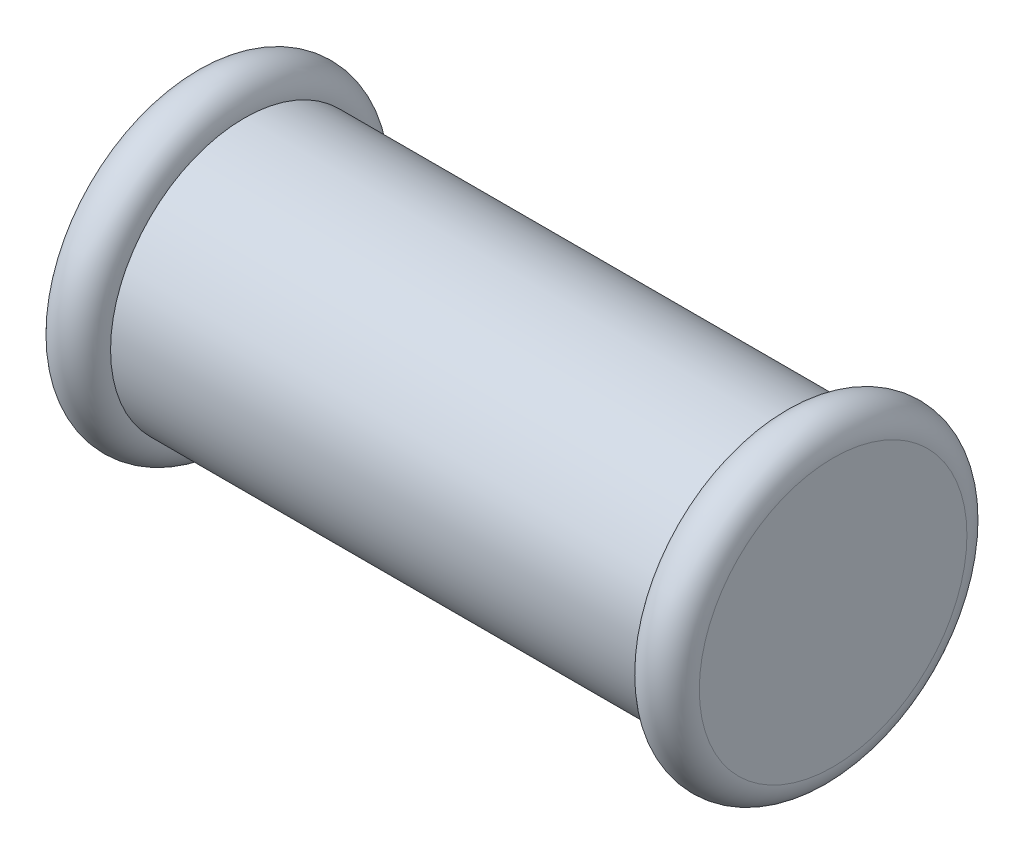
from build123d import *


with BuildPart() as part:
    # Sketch1 → Revolve1 (revolve)
    with BuildSketch(Plane.XY, mode=Mode.PRIVATE) as revolve1_sk:
        with BuildLine():
            Line((4, 10), (44, 10))
            ThreePointArc((44, 10), (46, 12), (48, 10))
            Line((48, 10), (48, 0))
            Line((48, 0), (0, 0))
            Line((0, 0), (0, 10))
            ThreePointArc((0, 10), (2, 12), (4, 10))
        make_face()
    revolve(revolve1_sk.sketch.rotate(Axis((-31.603712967, 0, 0), (1, 0, 0)), 90), axis=Axis((-31.603712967, 0, 0), (1, 0, 0)))


solid = part.part
